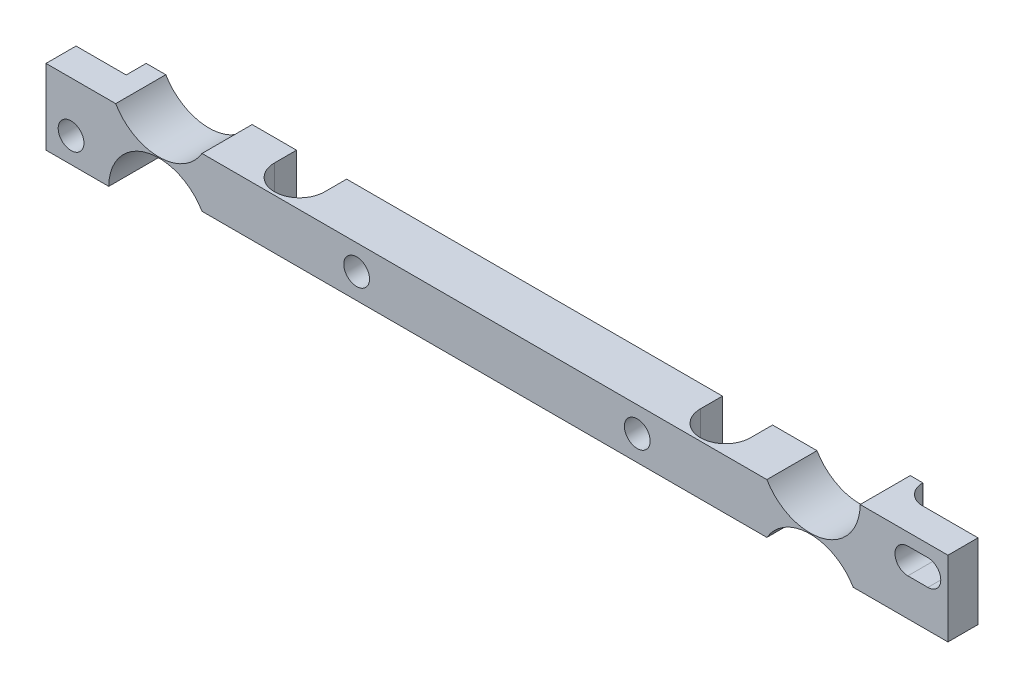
from build123d import *

# Parameters (mm, degrees)
SKETCH1_R          = 1.63195
EXTRUDE1_DEPTH     = 6.35
SKETCH2_W          = 6.35
SKETCH2_H          = 2.54
CUT_EXTRUDE1_DEPTH = 116.178567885
CUT_EXTRUDE2_DEPTH = 115.871833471
CUT_EXTRUDE3_DEPTH = 115.871833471
SKETCH5_R          = 1.63195
CUT_EXTRUDE4_DEPTH = 116.178567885


with BuildPart() as part:
    # Sketch1 → Extrude1 (new body)
    with BuildSketch(Plane.XY):
        with BuildLine():
            Line((0, 9.525), (0, 0))
            Line((0, 0), (7.950403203, 0))
            ThreePointArc((7.950403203, 0), (12.65282779, 6.081790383), (19.769817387, 3.175))
            Line((19.769817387, 3.175), (91.355182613, 3.175))
            ThreePointArc((91.355182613, 3.175), (96.8248, 6.2992), (102.294417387, 3.175))
            Line((102.294417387, 3.175), (114.3, 3.175))
            Line((114.3, 3.175), (114.3, 12.7))
            Line((114.3, 12.7), (103.174596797, 12.7))
            ThreePointArc((103.174596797, 12.7), (98.47217221, 6.618209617), (91.355182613, 9.525))
            Line((91.355182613, 9.525), (19.769817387, 9.525))
            ThreePointArc((19.769817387, 9.525), (14.3002, 6.4008), (8.830582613, 9.525))
            Line((8.830582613, 9.525), (0, 9.525))
        make_face()
        with BuildLine():
            Line((109.22, 11.15695), (111.76, 11.15695))
            ThreePointArc((111.76, 11.15695), (113.39195, 9.525), (111.76, 7.89305))
            Line((111.76, 7.89305), (109.22, 7.89305))
            ThreePointArc((109.22, 7.89305), (107.58805, 9.525), (109.22, 11.15695))
        make_face(mode=Mode.SUBTRACT)
        with Locations(Location((3.175, 3.175, 0), (0, 0, 180))):
            Circle(SKETCH1_R, mode=Mode.SUBTRACT)
    extrude(amount=EXTRUDE1_DEPTH)

    # Sketch2 → Cut-Extrude1 (cut, through all)
    with BuildSketch(Plane.XZ):
        with Locations((3.175, 1.27)):
            Rectangle(SKETCH2_W, SKETCH2_H)
    extrude(amount=-CUT_EXTRUDE1_DEPTH, mode=Mode.SUBTRACT)

    # Sketch3 → Cut-Extrude2 (cut, through all)
    with BuildSketch(Plane.XZ.offset(-3.175)):
        with BuildLine():
            Line((104.775, 0), (114.3, 0))
            Line((114.3, 0), (114.3, 2.54))
            Line((114.3, 2.54), (107.2896, 2.54))
            ThreePointArc((107.2896, 2.54), (105.511509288, 1.803490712), (104.775, 0.0254))
            Line((104.775, 0.0254), (104.775, 0))
        make_face()
    extrude(amount=-CUT_EXTRUDE2_DEPTH, mode=Mode.SUBTRACT)

    # Sketch4 → Cut-Extrude3 (cut, through all)
    with BuildSketch(Plane(origin=(0, 9.525, 0), x_dir=(1, 0, 0), z_dir=(0, 1, 0))):
        with BuildLine():
            ThreePointArc((25.4, -2.794), (25.848403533, -1.167255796), (27.066958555, 0))
            Line((27.066958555, 0), (25.4, 0))
            Line((25.4, 0), (25.4, -2.794))
        make_face()
        with BuildLine():
            Line((31.75, -2.794), (31.75, 0))
            Line((31.75, 0), (30.083041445, 0))
            ThreePointArc((30.083041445, 0), (31.301596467, -1.167255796), (31.75, -2.794))
        make_face()
        with BuildLine():
            ThreePointArc((31.75, -2.794), (31.301596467, -1.167255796), (30.083041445, 0))
            Line((30.083041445, 0), (27.066958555, 0))
            ThreePointArc((27.066958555, 0), (25.848403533, -1.167255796), (25.4, -2.794))
            Line((25.4, -2.794), (31.75, -2.794))
        make_face()
        with BuildLine():
            ThreePointArc((25.4, -2.794), (28.575, -5.969), (31.75, -2.794))
            Line((31.75, -2.794), (25.4, -2.794))
        make_face()
        with BuildLine():
            Line((79.375, 0), (79.375, -2.794))
            ThreePointArc((79.375, -2.794), (79.823403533, -1.167255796), (81.041958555, 0))
            Line((81.041958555, 0), (79.375, 0))
        make_face()
        with BuildLine():
            Line((79.375, -2.794), (85.725, -2.794))
            ThreePointArc((85.725, -2.794), (85.276596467, -1.167255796), (84.058041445, 0))
            Line((84.058041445, 0), (81.041958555, 0))
            ThreePointArc((81.041958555, 0), (79.823403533, -1.167255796), (79.375, -2.794))
        make_face()
        with BuildLine():
            ThreePointArc((84.058041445, 0), (85.276596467, -1.167255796), (85.725, -2.794))
            Line((85.725, -2.794), (85.725, 0))
            Line((85.725, 0), (84.058041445, 0))
        make_face()
        with BuildLine():
            ThreePointArc((79.375, -2.794), (82.55, -5.969), (85.725, -2.794))
            Line((85.725, -2.794), (79.375, -2.794))
        make_face()
    extrude(amount=-CUT_EXTRUDE3_DEPTH, mode=Mode.SUBTRACT)

    # Sketch5 → Cut-Extrude4 (cut, through all)
    with BuildSketch(Plane(origin=(0, 0, 0), x_dir=(-1, 0, 0), z_dir=(0, 0, -1))):
        with Locations((-74.93, 6.35)):
            Circle(SKETCH5_R)
        with Locations((-39.37, 6.35)):
            Circle(SKETCH5_R)
    extrude(amount=-CUT_EXTRUDE4_DEPTH, mode=Mode.SUBTRACT)


solid = part.part
